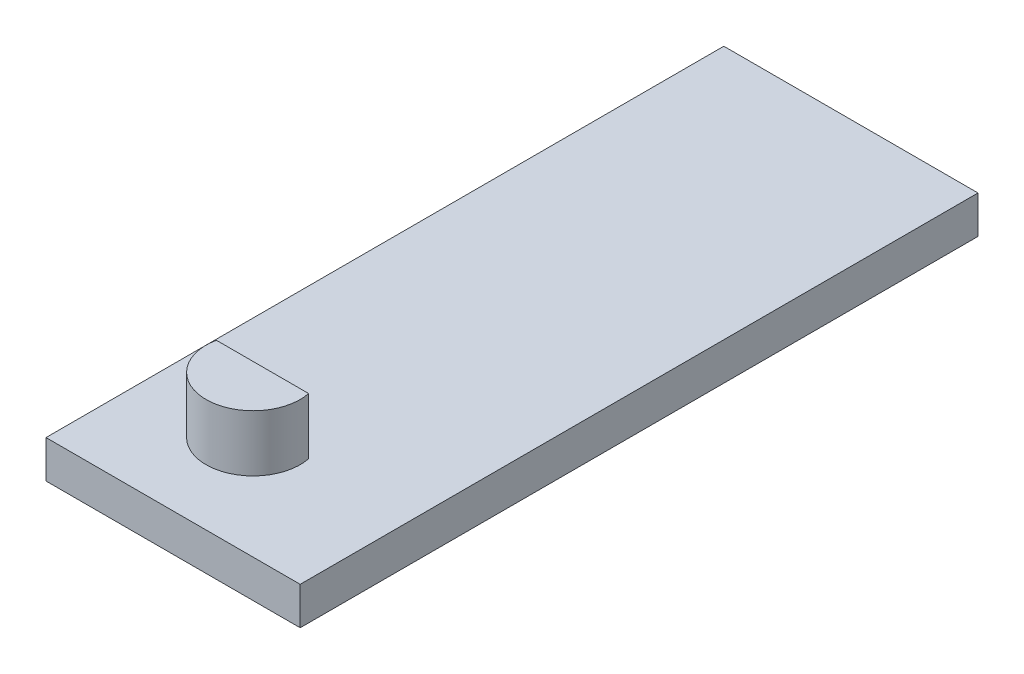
ISO-10303-21;
HEADER;
FILE_DESCRIPTION(('STEP AP214'),'2;1');
FILE_NAME('part.step','',(''),(''),'','','');
FILE_SCHEMA(('AUTOMOTIVE_DESIGN { 1 0 10303 214 1 1 1 1 }'));
ENDSEC;
DATA;
#1=APPLICATION_CONTEXT('core data for automotive mechanical design processes');
#2=APPLICATION_PROTOCOL_DEFINITION('international standard','automotive_design',2000,#1);
#3=PRODUCT_CONTEXT('',#1,'mechanical');
#4=PRODUCT('Part','Part','',(#3));
#5=PRODUCT_RELATED_PRODUCT_CATEGORY('part','',(#4));
#6=PRODUCT_DEFINITION_FORMATION('','',#4);
#7=PRODUCT_DEFINITION_CONTEXT('part definition',#1,'design');
#8=PRODUCT_DEFINITION('design','',#6,#7);
#9=PRODUCT_DEFINITION_SHAPE('','',#8);
#10=(LENGTH_UNIT() NAMED_UNIT(*) SI_UNIT(.MILLI.,.METRE.));
#11=(NAMED_UNIT(*) PLANE_ANGLE_UNIT() SI_UNIT($,.RADIAN.));
#12=(NAMED_UNIT(*) SI_UNIT($,.STERADIAN.) SOLID_ANGLE_UNIT());
#13=UNCERTAINTY_MEASURE_WITH_UNIT(LENGTH_MEASURE(1.E-05),#10,'distance_accuracy_value','');
#14=(GEOMETRIC_REPRESENTATION_CONTEXT(3) GLOBAL_UNCERTAINTY_ASSIGNED_CONTEXT((#13)) GLOBAL_UNIT_ASSIGNED_CONTEXT((#10,
#11,#12)) REPRESENTATION_CONTEXT('',''));
#15=CARTESIAN_POINT('',(0.,0.,0.));
#16=DIRECTION('',(0.,0.,1.));
#17=DIRECTION('',(1.,0.,0.));
#18=AXIS2_PLACEMENT_3D('',#15,#16,#17);
#19=CARTESIAN_POINT('',(0.,2.,-36.));
#20=DIRECTION('',(0.,-1.,0.));
#21=DIRECTION('',(0.,0.,-1.));
#22=AXIS2_PLACEMENT_3D('',#19,#20,#21);
#23=PLANE('',#22);
#24=DIRECTION('',(1.,0.,0.));
#25=VECTOR('',#24,1.);
#26=CARTESIAN_POINT('',(0.,2.,0.));
#27=LINE('',#26,#25);
#28=CARTESIAN_POINT('',(0.,2.,0.));
#29=VERTEX_POINT('',#28);
#30=CARTESIAN_POINT('',(13.5,2.,0.));
#31=VERTEX_POINT('',#30);
#32=EDGE_CURVE('E101',#29,#31,#27,.T.);
#33=ORIENTED_EDGE('',*,*,#32,.T.);
#34=DIRECTION('',(0.,0.,-1.));
#35=VECTOR('',#34,1.);
#36=CARTESIAN_POINT('',(13.5,2.,-36.));
#37=LINE('',#36,#35);
#38=CARTESIAN_POINT('',(13.5,2.,-36.));
#39=VERTEX_POINT('',#38);
#40=EDGE_CURVE('E112',#31,#39,#37,.T.);
#41=ORIENTED_EDGE('',*,*,#40,.T.);
#42=DIRECTION('',(-1.,0.,0.));
#43=VECTOR('',#42,1.);
#44=CARTESIAN_POINT('',(0.,2.,-36.));
#45=LINE('',#44,#43);
#46=CARTESIAN_POINT('',(0.,2.,-36.));
#47=VERTEX_POINT('',#46);
#48=EDGE_CURVE('E91',#39,#47,#45,.T.);
#49=ORIENTED_EDGE('',*,*,#48,.T.);
#50=DIRECTION('',(0.,0.,1.));
#51=VECTOR('',#50,1.);
#52=CARTESIAN_POINT('',(0.,2.,0.));
#53=LINE('',#52,#51);
#54=EDGE_CURVE('E97',#47,#29,#53,.T.);
#55=ORIENTED_EDGE('',*,*,#54,.T.);
#56=EDGE_LOOP('',(#33,#41,#49,#55));
#57=FACE_BOUND('',#56,.T.);
#58=CARTESIAN_POINT('',(5.5,2.,-5.5));
#59=DIRECTION('',(0.,1.,0.));
#60=DIRECTION('',(0.,0.,-1.));
#61=AXIS2_PLACEMENT_3D('',#58,#59,#60);
#62=CIRCLE('',#61,2.5);
#63=CARTESIAN_POINT('',(3.05051025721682,2.,-6.));
#64=VERTEX_POINT('',#63);
#65=CARTESIAN_POINT('',(7.94948974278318,2.,-6.));
#66=VERTEX_POINT('',#65);
#67=EDGE_CURVE('E113',#64,#66,#62,.T.);
#68=ORIENTED_EDGE('',*,*,#67,.F.);
#69=DIRECTION('',(-1.,0.,0.));
#70=VECTOR('',#69,1.);
#71=CARTESIAN_POINT('',(7.94948974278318,2.,-6.));
#72=LINE('',#71,#70);
#73=EDGE_CURVE('E48',#66,#64,#72,.T.);
#74=ORIENTED_EDGE('',*,*,#73,.F.);
#75=EDGE_LOOP('',(#68,#74));
#76=FACE_BOUND('',#75,.T.);
#77=ADVANCED_FACE('F26',(#57,#76),#23,.F.);
#78=CARTESIAN_POINT('',(0.,2.,0.));
#79=DIRECTION('',(1.,0.,0.));
#80=DIRECTION('',(0.,0.,-1.));
#81=AXIS2_PLACEMENT_3D('',#78,#79,#80);
#82=PLANE('',#81);
#83=DIRECTION('',(0.,0.,1.));
#84=VECTOR('',#83,1.);
#85=CARTESIAN_POINT('',(0.,0.,0.));
#86=LINE('',#85,#84);
#87=CARTESIAN_POINT('',(0.,0.,-36.));
#88=VERTEX_POINT('',#87);
#89=CARTESIAN_POINT('',(0.,0.,0.));
#90=VERTEX_POINT('',#89);
#91=EDGE_CURVE('E96',#88,#90,#86,.T.);
#92=ORIENTED_EDGE('',*,*,#91,.T.);
#93=DIRECTION('',(0.,-1.,0.));
#94=VECTOR('',#93,1.);
#95=CARTESIAN_POINT('',(0.,2.,0.));
#96=LINE('',#95,#94);
#97=EDGE_CURVE('E11',#29,#90,#96,.T.);
#98=ORIENTED_EDGE('',*,*,#97,.F.);
#99=ORIENTED_EDGE('',*,*,#54,.F.);
#100=DIRECTION('',(0.,-1.,0.));
#101=VECTOR('',#100,1.);
#102=CARTESIAN_POINT('',(0.,2.,-36.));
#103=LINE('',#102,#101);
#104=EDGE_CURVE('E34',#47,#88,#103,.T.);
#105=ORIENTED_EDGE('',*,*,#104,.T.);
#106=EDGE_LOOP('',(#92,#98,#99,#105));
#107=FACE_BOUND('',#106,.T.);
#108=ADVANCED_FACE('F28',(#107),#82,.F.);
#109=CARTESIAN_POINT('',(0.,2.,0.));
#110=DIRECTION('',(0.,0.,-1.));
#111=DIRECTION('',(-1.,0.,0.));
#112=AXIS2_PLACEMENT_3D('',#109,#110,#111);
#113=PLANE('',#112);
#114=DIRECTION('',(1.,0.,0.));
#115=VECTOR('',#114,1.);
#116=CARTESIAN_POINT('',(0.,0.,0.));
#117=LINE('',#116,#115);
#118=CARTESIAN_POINT('',(13.5,0.,0.));
#119=VERTEX_POINT('',#118);
#120=EDGE_CURVE('E98',#90,#119,#117,.T.);
#121=ORIENTED_EDGE('',*,*,#120,.T.);
#122=DIRECTION('',(0.,1.,0.));
#123=VECTOR('',#122,1.);
#124=CARTESIAN_POINT('',(13.5,0.,0.));
#125=LINE('',#124,#123);
#126=EDGE_CURVE('E41',#119,#31,#125,.T.);
#127=ORIENTED_EDGE('',*,*,#126,.T.);
#128=ORIENTED_EDGE('',*,*,#32,.F.);
#129=ORIENTED_EDGE('',*,*,#97,.T.);
#130=EDGE_LOOP('',(#121,#127,#128,#129));
#131=FACE_BOUND('',#130,.T.);
#132=ADVANCED_FACE('F143',(#131),#113,.F.);
#133=CARTESIAN_POINT('',(0.,2.,-36.));
#134=DIRECTION('',(0.,0.,1.));
#135=DIRECTION('',(1.,0.,0.));
#136=AXIS2_PLACEMENT_3D('',#133,#134,#135);
#137=PLANE('',#136);
#138=ORIENTED_EDGE('',*,*,#48,.F.);
#139=DIRECTION('',(0.,1.,0.));
#140=VECTOR('',#139,1.);
#141=CARTESIAN_POINT('',(13.5,0.,-36.));
#142=LINE('',#141,#140);
#143=CARTESIAN_POINT('',(13.5,0.,-36.));
#144=VERTEX_POINT('',#143);
#145=EDGE_CURVE('E79',#144,#39,#142,.T.);
#146=ORIENTED_EDGE('',*,*,#145,.F.);
#147=DIRECTION('',(-1.,0.,0.));
#148=VECTOR('',#147,1.);
#149=CARTESIAN_POINT('',(0.,0.,-36.));
#150=LINE('',#149,#148);
#151=EDGE_CURVE('E89',#144,#88,#150,.T.);
#152=ORIENTED_EDGE('',*,*,#151,.T.);
#153=ORIENTED_EDGE('',*,*,#104,.F.);
#154=EDGE_LOOP('',(#138,#146,#152,#153));
#155=FACE_BOUND('',#154,.T.);
#156=ADVANCED_FACE('F87',(#155),#137,.F.);
#157=CARTESIAN_POINT('',(0.,0.,-36.));
#158=DIRECTION('',(0.,-1.,0.));
#159=DIRECTION('',(0.,0.,-1.));
#160=AXIS2_PLACEMENT_3D('',#157,#158,#159);
#161=PLANE('',#160);
#162=DIRECTION('',(0.,0.,1.));
#163=VECTOR('',#162,1.);
#164=CARTESIAN_POINT('',(13.5,0.,-36.));
#165=LINE('',#164,#163);
#166=EDGE_CURVE('E76',#144,#119,#165,.T.);
#167=ORIENTED_EDGE('',*,*,#166,.T.);
#168=ORIENTED_EDGE('',*,*,#120,.F.);
#169=ORIENTED_EDGE('',*,*,#91,.F.);
#170=ORIENTED_EDGE('',*,*,#151,.F.);
#171=EDGE_LOOP('',(#167,#168,#169,#170));
#172=FACE_BOUND('',#171,.T.);
#173=ADVANCED_FACE('F94',(#172),#161,.T.);
#174=CARTESIAN_POINT('',(5.5,5.,-5.5));
#175=DIRECTION('',(0.,-1.,0.));
#176=DIRECTION('',(0.,0.,-1.));
#177=AXIS2_PLACEMENT_3D('',#174,#175,#176);
#178=CYLINDRICAL_SURFACE('',#177,2.5);
#179=ORIENTED_EDGE('',*,*,#67,.T.);
#180=DIRECTION('',(0.,-1.,0.));
#181=VECTOR('',#180,1.);
#182=CARTESIAN_POINT('',(7.94948974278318,5.,-6.));
#183=LINE('',#182,#181);
#184=CARTESIAN_POINT('',(7.94948974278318,5.,-6.));
#185=VERTEX_POINT('',#184);
#186=EDGE_CURVE('E128',#185,#66,#183,.T.);
#187=ORIENTED_EDGE('',*,*,#186,.F.);
#188=CARTESIAN_POINT('',(5.5,5.,-5.5));
#189=DIRECTION('',(0.,1.,0.));
#190=DIRECTION('',(0.,0.,-1.));
#191=AXIS2_PLACEMENT_3D('',#188,#189,#190);
#192=CIRCLE('',#191,2.5);
#193=CARTESIAN_POINT('',(3.05051025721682,5.,-6.));
#194=VERTEX_POINT('',#193);
#195=EDGE_CURVE('E120',#194,#185,#192,.T.);
#196=ORIENTED_EDGE('',*,*,#195,.F.);
#197=DIRECTION('',(0.,-1.,0.));
#198=VECTOR('',#197,1.);
#199=CARTESIAN_POINT('',(3.05051025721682,5.,-6.));
#200=LINE('',#199,#198);
#201=EDGE_CURVE('E125',#194,#64,#200,.T.);
#202=ORIENTED_EDGE('',*,*,#201,.T.);
#203=EDGE_LOOP('',(#179,#187,#196,#202));
#204=FACE_BOUND('',#203,.T.);
#205=ADVANCED_FACE('F135',(#204),#178,.T.);
#206=CARTESIAN_POINT('',(7.94948974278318,5.,-6.));
#207=DIRECTION('',(0.,0.,1.));
#208=DIRECTION('',(1.,0.,0.));
#209=AXIS2_PLACEMENT_3D('',#206,#207,#208);
#210=PLANE('',#209);
#211=ORIENTED_EDGE('',*,*,#73,.T.);
#212=ORIENTED_EDGE('',*,*,#201,.F.);
#213=DIRECTION('',(-1.,0.,0.));
#214=VECTOR('',#213,1.);
#215=CARTESIAN_POINT('',(7.94948974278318,5.,-6.));
#216=LINE('',#215,#214);
#217=EDGE_CURVE('E123',#185,#194,#216,.T.);
#218=ORIENTED_EDGE('',*,*,#217,.F.);
#219=ORIENTED_EDGE('',*,*,#186,.T.);
#220=EDGE_LOOP('',(#211,#212,#218,#219));
#221=FACE_BOUND('',#220,.T.);
#222=ADVANCED_FACE('F131',(#221),#210,.F.);
#223=CARTESIAN_POINT('',(5.5,5.,-5.5));
#224=DIRECTION('',(0.,-1.,0.));
#225=DIRECTION('',(0.,0.,-1.));
#226=AXIS2_PLACEMENT_3D('',#223,#224,#225);
#227=PLANE('',#226);
#228=ORIENTED_EDGE('',*,*,#195,.T.);
#229=ORIENTED_EDGE('',*,*,#217,.T.);
#230=EDGE_LOOP('',(#228,#229));
#231=FACE_BOUND('',#230,.T.);
#232=ADVANCED_FACE('F166',(#231),#227,.F.);
#233=CARTESIAN_POINT('',(13.5,0.,-36.));
#234=DIRECTION('',(-1.,0.,0.));
#235=DIRECTION('',(0.,0.,1.));
#236=AXIS2_PLACEMENT_3D('',#233,#234,#235);
#237=PLANE('',#236);
#238=ORIENTED_EDGE('',*,*,#126,.F.);
#239=ORIENTED_EDGE('',*,*,#166,.F.);
#240=ORIENTED_EDGE('',*,*,#145,.T.);
#241=ORIENTED_EDGE('',*,*,#40,.F.);
#242=EDGE_LOOP('',(#238,#239,#240,#241));
#243=FACE_BOUND('',#242,.T.);
#244=ADVANCED_FACE('F78',(#243),#237,.F.);
#245=CLOSED_SHELL('',(#77,#108,#132,#156,#173,#205,#222,#232,#244));
#246=MANIFOLD_SOLID_BREP('B2',#245);
#247=ADVANCED_BREP_SHAPE_REPRESENTATION('',(#18,#246),#14);
#248=SHAPE_DEFINITION_REPRESENTATION(#9,#247);
ENDSEC;
END-ISO-10303-21;
